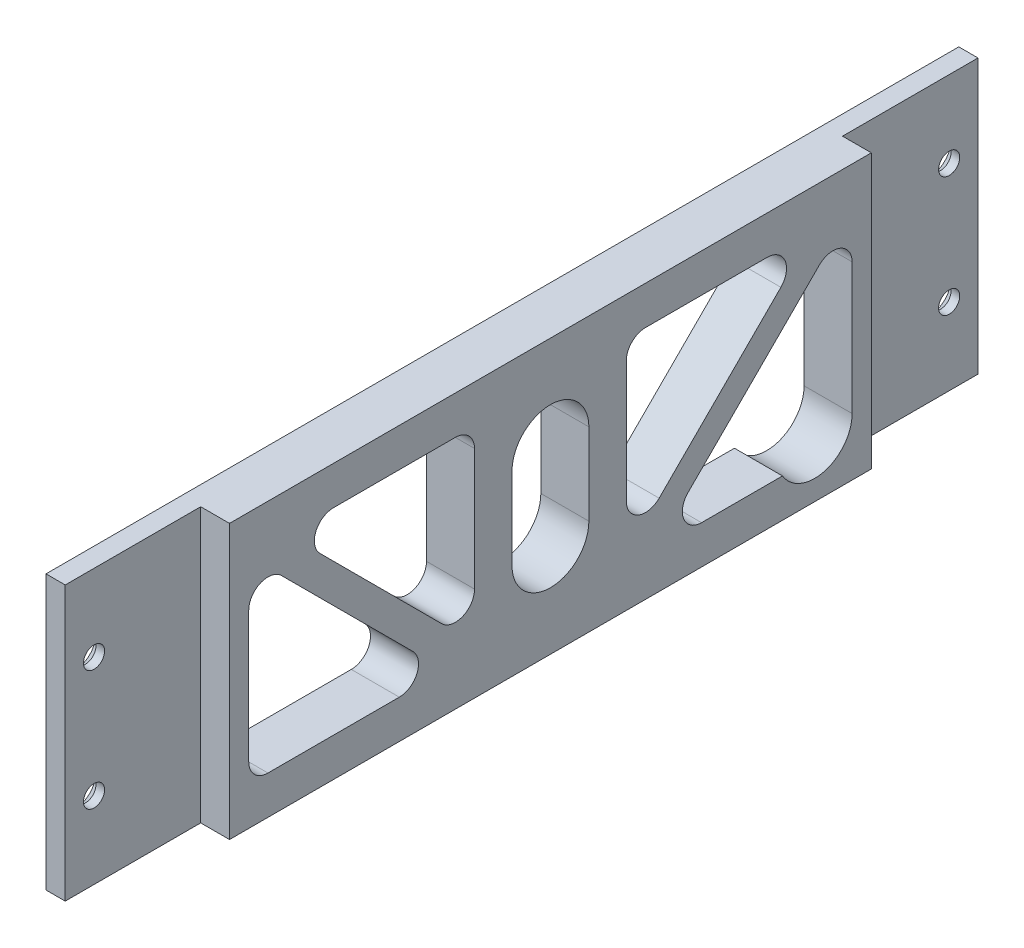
ISO-10303-21;
HEADER;
FILE_DESCRIPTION(('STEP AP214'),'2;1');
FILE_NAME('part.step','',(''),(''),'','','');
FILE_SCHEMA(('AUTOMOTIVE_DESIGN { 1 0 10303 214 1 1 1 1 }'));
ENDSEC;
DATA;
#1=APPLICATION_CONTEXT('core data for automotive mechanical design processes');
#2=APPLICATION_PROTOCOL_DEFINITION('international standard','automotive_design',2000,#1);
#3=PRODUCT_CONTEXT('',#1,'mechanical');
#4=PRODUCT('Part','Part','',(#3));
#5=PRODUCT_RELATED_PRODUCT_CATEGORY('part','',(#4));
#6=PRODUCT_DEFINITION_FORMATION('','',#4);
#7=PRODUCT_DEFINITION_CONTEXT('part definition',#1,'design');
#8=PRODUCT_DEFINITION('design','',#6,#7);
#9=PRODUCT_DEFINITION_SHAPE('','',#8);
#10=(LENGTH_UNIT() NAMED_UNIT(*) SI_UNIT(.MILLI.,.METRE.));
#11=(NAMED_UNIT(*) PLANE_ANGLE_UNIT() SI_UNIT($,.RADIAN.));
#12=(NAMED_UNIT(*) SI_UNIT($,.STERADIAN.) SOLID_ANGLE_UNIT());
#13=UNCERTAINTY_MEASURE_WITH_UNIT(LENGTH_MEASURE(1.E-05),#10,'distance_accuracy_value','');
#14=(GEOMETRIC_REPRESENTATION_CONTEXT(3) GLOBAL_UNCERTAINTY_ASSIGNED_CONTEXT((#13)) GLOBAL_UNIT_ASSIGNED_CONTEXT((#10,
#11,#12)) REPRESENTATION_CONTEXT('',''));
#15=CARTESIAN_POINT('',(0.,0.,0.));
#16=DIRECTION('',(0.,0.,1.));
#17=DIRECTION('',(1.,0.,0.));
#18=AXIS2_PLACEMENT_3D('',#15,#16,#17);
#19=CARTESIAN_POINT('',(0.,0.,0.));
#20=DIRECTION('',(-1.,0.,0.));
#21=DIRECTION('',(0.,0.,1.));
#22=AXIS2_PLACEMENT_3D('',#19,#20,#21);
#23=PLANE('',#22);
#24=CARTESIAN_POINT('',(0.,-8.25000000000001,-27.5));
#25=DIRECTION('',(-1.,0.,0.));
#26=DIRECTION('',(0.,0.,1.));
#27=AXIS2_PLACEMENT_3D('',#24,#25,#26);
#28=CIRCLE('',#27,3.9);
#29=CARTESIAN_POINT('',(0.,-8.25000000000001,-31.4));
#30=VERTEX_POINT('',#29);
#31=CARTESIAN_POINT('',(0.,-10.25,-24.1518661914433));
#32=VERTEX_POINT('',#31);
#33=EDGE_CURVE('E48',#30,#32,#28,.T.);
#34=ORIENTED_EDGE('',*,*,#33,.F.);
#35=DIRECTION('',(0.,-1.,0.));
#36=VECTOR('',#35,1.);
#37=CARTESIAN_POINT('',(0.,5.42157287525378,-31.4));
#38=LINE('',#37,#36);
#39=CARTESIAN_POINT('',(0.,5.42157287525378,-31.4));
#40=VERTEX_POINT('',#39);
#41=EDGE_CURVE('E280',#40,#30,#38,.T.);
#42=ORIENTED_EDGE('',*,*,#41,.F.);
#43=CARTESIAN_POINT('',(0.,5.42157287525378,-29.4));
#44=DIRECTION('',(-1.,0.,0.));
#45=DIRECTION('',(0.,0.,-1.));
#46=AXIS2_PLACEMENT_3D('',#43,#44,#45);
#47=CIRCLE('',#46,2.);
#48=CARTESIAN_POINT('',(0.,6.83578643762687,-27.9857864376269));
#49=VERTEX_POINT('',#48);
#50=EDGE_CURVE('E287',#49,#40,#47,.T.);
#51=ORIENTED_EDGE('',*,*,#50,.F.);
#52=DIRECTION('',(0.,0.707106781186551,-0.707106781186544));
#53=VECTOR('',#52,1.);
#54=CARTESIAN_POINT('',(0.,-6.83578643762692,-14.3142135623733));
#55=LINE('',#54,#53);
#56=CARTESIAN_POINT('',(0.,-6.83578643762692,-14.3142135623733));
#57=VERTEX_POINT('',#56);
#58=EDGE_CURVE('E292',#57,#49,#55,.T.);
#59=ORIENTED_EDGE('',*,*,#58,.F.);
#60=CARTESIAN_POINT('',(0.,-8.25000000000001,-15.7284271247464));
#61=DIRECTION('',(-1.,0.,0.));
#62=DIRECTION('',(0.,0.,1.));
#63=AXIS2_PLACEMENT_3D('',#60,#61,#62);
#64=CIRCLE('',#63,2.);
#65=CARTESIAN_POINT('',(0.,-10.25,-15.7284271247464));
#66=VERTEX_POINT('',#65);
#67=EDGE_CURVE('E559',#66,#57,#64,.T.);
#68=ORIENTED_EDGE('',*,*,#67,.F.);
#69=DIRECTION('',(0.,0.,1.));
#70=VECTOR('',#69,1.);
#71=CARTESIAN_POINT('',(0.,-10.25,-29.4));
#72=LINE('',#71,#70);
#73=EDGE_CURVE('E282',#32,#66,#72,.T.);
#74=ORIENTED_EDGE('',*,*,#73,.F.);
#75=EDGE_LOOP('',(#34,#42,#51,#59,#68,#74));
#76=FACE_BOUND('',#75,.T.);
#77=CARTESIAN_POINT('',(0.,4.25,0.));
#78=DIRECTION('',(-1.,0.,0.));
#79=DIRECTION('',(0.,0.,1.));
#80=AXIS2_PLACEMENT_3D('',#77,#78,#79);
#81=CIRCLE('',#80,4.);
#82=CARTESIAN_POINT('',(0.,4.25,4.));
#83=VERTEX_POINT('',#82);
#84=CARTESIAN_POINT('',(0.,4.25,-4.));
#85=VERTEX_POINT('',#84);
#86=EDGE_CURVE('E55',#83,#85,#81,.T.);
#87=ORIENTED_EDGE('',*,*,#86,.F.);
#88=DIRECTION('',(0.,1.,0.));
#89=VECTOR('',#88,1.);
#90=CARTESIAN_POINT('',(0.,4.25,4.));
#91=LINE('',#90,#89);
#92=CARTESIAN_POINT('',(0.,-4.25000000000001,4.));
#93=VERTEX_POINT('',#92);
#94=EDGE_CURVE('E478',#93,#83,#91,.T.);
#95=ORIENTED_EDGE('',*,*,#94,.F.);
#96=CARTESIAN_POINT('',(0.,-4.25000000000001,0.));
#97=DIRECTION('',(-1.,0.,0.));
#98=DIRECTION('',(0.,0.,1.));
#99=AXIS2_PLACEMENT_3D('',#96,#97,#98);
#100=CIRCLE('',#99,4.);
#101=CARTESIAN_POINT('',(0.,-4.25000000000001,-4.));
#102=VERTEX_POINT('',#101);
#103=EDGE_CURVE('E491',#102,#93,#100,.T.);
#104=ORIENTED_EDGE('',*,*,#103,.F.);
#105=DIRECTION('',(0.,-1.,0.));
#106=VECTOR('',#105,1.);
#107=CARTESIAN_POINT('',(0.,4.25,-4.));
#108=LINE('',#107,#106);
#109=EDGE_CURVE('E578',#85,#102,#108,.T.);
#110=ORIENTED_EDGE('',*,*,#109,.F.);
#111=EDGE_LOOP('',(#87,#95,#104,#110));
#112=FACE_BOUND('',#111,.T.);
#113=DIRECTION('',(0.,0.,1.));
#114=VECTOR('',#113,1.);
#115=CARTESIAN_POINT('',(0.,10.25,22.5715728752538));
#116=LINE('',#115,#114);
#117=CARTESIAN_POINT('',(0.,10.25,9.90000000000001));
#118=VERTEX_POINT('',#117);
#119=CARTESIAN_POINT('',(0.,10.25,22.5715728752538));
#120=VERTEX_POINT('',#119);
#121=EDGE_CURVE('E530',#118,#120,#116,.T.);
#122=ORIENTED_EDGE('',*,*,#121,.T.);
#123=CARTESIAN_POINT('',(0.,8.25,22.5715728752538));
#124=DIRECTION('',(1.,0.,0.));
#125=DIRECTION('',(0.,0.,-1.));
#126=AXIS2_PLACEMENT_3D('',#123,#124,#125);
#127=CIRCLE('',#126,2.);
#128=CARTESIAN_POINT('',(0.,6.8357864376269,23.9857864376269));
#129=VERTEX_POINT('',#128);
#130=EDGE_CURVE('E527',#120,#129,#127,.T.);
#131=ORIENTED_EDGE('',*,*,#130,.T.);
#132=DIRECTION('',(0.,-0.707106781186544,-0.707106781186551));
#133=VECTOR('',#132,1.);
#134=CARTESIAN_POINT('',(0.,-5.83578643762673,11.3142135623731));
#135=LINE('',#134,#133);
#136=CARTESIAN_POINT('',(0.,-5.83578643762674,11.3142135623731));
#137=VERTEX_POINT('',#136);
#138=EDGE_CURVE('E542',#129,#137,#135,.T.);
#139=ORIENTED_EDGE('',*,*,#138,.T.);
#140=CARTESIAN_POINT('',(0.,-4.42157287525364,9.9));
#141=DIRECTION('',(1.,0.,0.));
#142=DIRECTION('',(0.,0.,1.));
#143=AXIS2_PLACEMENT_3D('',#140,#141,#142);
#144=CIRCLE('',#143,2.);
#145=CARTESIAN_POINT('',(0.,-4.42157287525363,7.9));
#146=VERTEX_POINT('',#145);
#147=EDGE_CURVE('E539',#137,#146,#144,.T.);
#148=ORIENTED_EDGE('',*,*,#147,.T.);
#149=DIRECTION('',(0.,1.,0.));
#150=VECTOR('',#149,1.);
#151=CARTESIAN_POINT('',(0.,8.24999999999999,7.9));
#152=LINE('',#151,#150);
#153=CARTESIAN_POINT('',(0.,8.24999999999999,7.9));
#154=VERTEX_POINT('',#153);
#155=EDGE_CURVE('E536',#146,#154,#152,.T.);
#156=ORIENTED_EDGE('',*,*,#155,.T.);
#157=CARTESIAN_POINT('',(0.,8.25,9.9));
#158=DIRECTION('',(1.,0.,0.));
#159=DIRECTION('',(0.,0.,1.));
#160=AXIS2_PLACEMENT_3D('',#157,#158,#159);
#161=CIRCLE('',#160,2.);
#162=EDGE_CURVE('E533',#154,#118,#161,.T.);
#163=ORIENTED_EDGE('',*,*,#162,.T.);
#164=EDGE_LOOP('',(#122,#131,#139,#148,#156,#163));
#165=FACE_BOUND('',#164,.T.);
#166=CARTESIAN_POINT('',(0.,8.25,-22.5715728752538));
#167=DIRECTION('',(-1.,0.,0.));
#168=DIRECTION('',(0.,0.,1.));
#169=AXIS2_PLACEMENT_3D('',#166,#167,#168);
#170=CIRCLE('',#169,2.);
#171=CARTESIAN_POINT('',(0.,10.25,-22.5715728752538));
#172=VERTEX_POINT('',#171);
#173=CARTESIAN_POINT('',(0.,6.8357864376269,-23.9857864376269));
#174=VERTEX_POINT('',#173);
#175=EDGE_CURVE('E272',#172,#174,#170,.T.);
#176=ORIENTED_EDGE('',*,*,#175,.F.);
#177=DIRECTION('',(0.,0.,-1.));
#178=VECTOR('',#177,1.);
#179=CARTESIAN_POINT('',(0.,10.25,-22.5715728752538));
#180=LINE('',#179,#178);
#181=CARTESIAN_POINT('',(0.,10.25,-9.90000000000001));
#182=VERTEX_POINT('',#181);
#183=EDGE_CURVE('E313',#182,#172,#180,.T.);
#184=ORIENTED_EDGE('',*,*,#183,.F.);
#185=CARTESIAN_POINT('',(0.,8.25,-9.9));
#186=DIRECTION('',(-1.,0.,0.));
#187=DIRECTION('',(0.,0.,-1.));
#188=AXIS2_PLACEMENT_3D('',#185,#186,#187);
#189=CIRCLE('',#188,2.);
#190=CARTESIAN_POINT('',(0.,8.24999999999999,-7.9));
#191=VERTEX_POINT('',#190);
#192=EDGE_CURVE('E310',#191,#182,#189,.T.);
#193=ORIENTED_EDGE('',*,*,#192,.F.);
#194=DIRECTION('',(0.,1.,0.));
#195=VECTOR('',#194,1.);
#196=CARTESIAN_POINT('',(0.,8.24999999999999,-7.9));
#197=LINE('',#196,#195);
#198=CARTESIAN_POINT('',(0.,-4.42157287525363,-7.9));
#199=VERTEX_POINT('',#198);
#200=EDGE_CURVE('E307',#199,#191,#197,.T.);
#201=ORIENTED_EDGE('',*,*,#200,.F.);
#202=CARTESIAN_POINT('',(0.,-4.42157287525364,-9.9));
#203=DIRECTION('',(-1.,0.,0.));
#204=DIRECTION('',(0.,0.,-1.));
#205=AXIS2_PLACEMENT_3D('',#202,#203,#204);
#206=CIRCLE('',#205,2.);
#207=CARTESIAN_POINT('',(0.,-5.83578643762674,-11.3142135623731));
#208=VERTEX_POINT('',#207);
#209=EDGE_CURVE('E304',#208,#199,#206,.T.);
#210=ORIENTED_EDGE('',*,*,#209,.F.);
#211=DIRECTION('',(0.,-0.707106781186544,0.707106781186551));
#212=VECTOR('',#211,1.);
#213=CARTESIAN_POINT('',(0.,-5.83578643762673,-11.3142135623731));
#214=LINE('',#213,#212);
#215=EDGE_CURVE('E301',#174,#208,#214,.T.);
#216=ORIENTED_EDGE('',*,*,#215,.F.);
#217=EDGE_LOOP('',(#176,#184,#193,#201,#210,#216));
#218=FACE_BOUND('',#217,.T.);
#219=CARTESIAN_POINT('',(0.,6.25,44.5));
#220=DIRECTION('',(-1.,0.,0.));
#221=DIRECTION('',(0.,0.,1.));
#222=AXIS2_PLACEMENT_3D('',#219,#220,#221);
#223=CIRCLE('',#222,2.2);
#224=CARTESIAN_POINT('',(0.,6.25,46.7));
#225=VERTEX_POINT('',#224);
#226=EDGE_CURVE('E329',#225,#225,#223,.T.);
#227=ORIENTED_EDGE('',*,*,#226,.F.);
#228=EDGE_LOOP('',(#227));
#229=FACE_BOUND('',#228,.T.);
#230=CARTESIAN_POINT('',(0.,-6.25000000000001,44.5));
#231=DIRECTION('',(-1.,0.,0.));
#232=DIRECTION('',(0.,0.,1.));
#233=AXIS2_PLACEMENT_3D('',#230,#231,#232);
#234=CIRCLE('',#233,2.2);
#235=CARTESIAN_POINT('',(0.,-6.25000000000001,46.7));
#236=VERTEX_POINT('',#235);
#237=EDGE_CURVE('E336',#236,#236,#234,.T.);
#238=ORIENTED_EDGE('',*,*,#237,.F.);
#239=EDGE_LOOP('',(#238));
#240=FACE_BOUND('',#239,.T.);
#241=CARTESIAN_POINT('',(0.,6.25,-44.5));
#242=DIRECTION('',(-1.,0.,0.));
#243=DIRECTION('',(0.,0.,1.));
#244=AXIS2_PLACEMENT_3D('',#241,#242,#243);
#245=CIRCLE('',#244,2.2);
#246=CARTESIAN_POINT('',(0.,6.25,-42.3));
#247=VERTEX_POINT('',#246);
#248=EDGE_CURVE('E343',#247,#247,#245,.T.);
#249=ORIENTED_EDGE('',*,*,#248,.F.);
#250=EDGE_LOOP('',(#249));
#251=FACE_BOUND('',#250,.T.);
#252=CARTESIAN_POINT('',(0.,-6.25000000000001,-44.5));
#253=DIRECTION('',(-1.,0.,0.));
#254=DIRECTION('',(0.,0.,1.));
#255=AXIS2_PLACEMENT_3D('',#252,#253,#254);
#256=CIRCLE('',#255,2.2);
#257=CARTESIAN_POINT('',(0.,-6.25000000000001,-42.3));
#258=VERTEX_POINT('',#257);
#259=EDGE_CURVE('E350',#258,#258,#256,.T.);
#260=ORIENTED_EDGE('',*,*,#259,.F.);
#261=EDGE_LOOP('',(#260));
#262=FACE_BOUND('',#261,.T.);
#263=DIRECTION('',(0.,-1.,0.));
#264=VECTOR('',#263,1.);
#265=CARTESIAN_POINT('',(0.,14.25,47.5));
#266=LINE('',#265,#264);
#267=CARTESIAN_POINT('',(0.,14.25,47.5));
#268=VERTEX_POINT('',#267);
#269=CARTESIAN_POINT('',(0.,-14.25,47.5));
#270=VERTEX_POINT('',#269);
#271=EDGE_CURVE('E606',#268,#270,#266,.T.);
#272=ORIENTED_EDGE('',*,*,#271,.F.);
#273=DIRECTION('',(0.,0.,1.));
#274=VECTOR('',#273,1.);
#275=CARTESIAN_POINT('',(0.,14.25,-47.5));
#276=LINE('',#275,#274);
#277=CARTESIAN_POINT('',(0.,14.25,-47.5));
#278=VERTEX_POINT('',#277);
#279=EDGE_CURVE('E682',#278,#268,#276,.T.);
#280=ORIENTED_EDGE('',*,*,#279,.F.);
#281=DIRECTION('',(0.,1.,0.));
#282=VECTOR('',#281,1.);
#283=CARTESIAN_POINT('',(0.,14.25,-47.5));
#284=LINE('',#283,#282);
#285=CARTESIAN_POINT('',(0.,-14.25,-47.5));
#286=VERTEX_POINT('',#285);
#287=EDGE_CURVE('E675',#286,#278,#284,.T.);
#288=ORIENTED_EDGE('',*,*,#287,.F.);
#289=DIRECTION('',(0.,0.,-1.));
#290=VECTOR('',#289,1.);
#291=CARTESIAN_POINT('',(0.,-14.25,-47.5));
#292=LINE('',#291,#290);
#293=EDGE_CURVE('E668',#270,#286,#292,.T.);
#294=ORIENTED_EDGE('',*,*,#293,.F.);
#295=EDGE_LOOP('',(#272,#280,#288,#294));
#296=FACE_BOUND('',#295,.T.);
#297=DIRECTION('',(0.,-1.,0.));
#298=VECTOR('',#297,1.);
#299=CARTESIAN_POINT('',(0.,5.42157287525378,31.4));
#300=LINE('',#299,#298);
#301=CARTESIAN_POINT('',(0.,5.42157287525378,31.4));
#302=VERTEX_POINT('',#301);
#303=CARTESIAN_POINT('',(0.,-8.24999999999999,31.4));
#304=VERTEX_POINT('',#303);
#305=EDGE_CURVE('E499',#302,#304,#300,.T.);
#306=ORIENTED_EDGE('',*,*,#305,.T.);
#307=CARTESIAN_POINT('',(0.,-8.25000000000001,29.4));
#308=DIRECTION('',(1.,0.,0.));
#309=DIRECTION('',(0.,0.,-1.));
#310=AXIS2_PLACEMENT_3D('',#307,#308,#309);
#311=CIRCLE('',#310,2.);
#312=CARTESIAN_POINT('',(0.,-10.25,29.4));
#313=VERTEX_POINT('',#312);
#314=EDGE_CURVE('E479',#304,#313,#311,.T.);
#315=ORIENTED_EDGE('',*,*,#314,.T.);
#316=DIRECTION('',(0.,0.,-1.));
#317=VECTOR('',#316,1.);
#318=CARTESIAN_POINT('',(0.,-10.25,29.4));
#319=LINE('',#318,#317);
#320=CARTESIAN_POINT('',(0.,-10.25,15.7284271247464));
#321=VERTEX_POINT('',#320);
#322=EDGE_CURVE('E511',#313,#321,#319,.T.);
#323=ORIENTED_EDGE('',*,*,#322,.T.);
#324=CARTESIAN_POINT('',(0.,-8.25000000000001,15.7284271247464));
#325=DIRECTION('',(1.,0.,0.));
#326=DIRECTION('',(0.,0.,-1.));
#327=AXIS2_PLACEMENT_3D('',#324,#325,#326);
#328=CIRCLE('',#327,2.);
#329=CARTESIAN_POINT('',(0.,-6.83578643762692,14.3142135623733));
#330=VERTEX_POINT('',#329);
#331=EDGE_CURVE('E508',#321,#330,#328,.T.);
#332=ORIENTED_EDGE('',*,*,#331,.T.);
#333=DIRECTION('',(0.,0.707106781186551,0.707106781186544));
#334=VECTOR('',#333,1.);
#335=CARTESIAN_POINT('',(0.,-6.83578643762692,14.3142135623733));
#336=LINE('',#335,#334);
#337=CARTESIAN_POINT('',(0.,6.83578643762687,27.9857864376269));
#338=VERTEX_POINT('',#337);
#339=EDGE_CURVE('E505',#330,#338,#336,.T.);
#340=ORIENTED_EDGE('',*,*,#339,.T.);
#341=CARTESIAN_POINT('',(0.,5.42157287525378,29.4));
#342=DIRECTION('',(1.,0.,0.));
#343=DIRECTION('',(0.,0.,1.));
#344=AXIS2_PLACEMENT_3D('',#341,#342,#343);
#345=CIRCLE('',#344,2.);
#346=EDGE_CURVE('E502',#338,#302,#345,.T.);
#347=ORIENTED_EDGE('',*,*,#346,.T.);
#348=EDGE_LOOP('',(#306,#315,#323,#332,#340,#347));
#349=FACE_BOUND('',#348,.T.);
#350=ADVANCED_FACE('F33',(#76,#112,#165,#218,#229,#240,#251,#262,#296,#349),#23,.T.);
#351=CARTESIAN_POINT('',(5.,0.,0.));
#352=DIRECTION('',(1.,0.,0.));
#353=DIRECTION('',(0.,0.,-1.));
#354=AXIS2_PLACEMENT_3D('',#351,#352,#353);
#355=PLANE('',#354);
#356=CARTESIAN_POINT('',(5.,-8.25000000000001,-27.5));
#357=DIRECTION('',(1.,0.,0.));
#358=DIRECTION('',(0.,0.,-1.));
#359=AXIS2_PLACEMENT_3D('',#356,#357,#358);
#360=CIRCLE('',#359,3.9);
#361=CARTESIAN_POINT('',(5.,-10.25,-24.1518661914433));
#362=VERTEX_POINT('',#361);
#363=CARTESIAN_POINT('',(5.,-8.25000000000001,-31.4));
#364=VERTEX_POINT('',#363);
#365=EDGE_CURVE('E267',#362,#364,#360,.T.);
#366=ORIENTED_EDGE('',*,*,#365,.F.);
#367=DIRECTION('',(0.,0.,-1.));
#368=VECTOR('',#367,1.);
#369=CARTESIAN_POINT('',(5.,-10.25,-29.4));
#370=LINE('',#369,#368);
#371=CARTESIAN_POINT('',(5.,-10.25,-15.7284271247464));
#372=VERTEX_POINT('',#371);
#373=EDGE_CURVE('E410',#372,#362,#370,.T.);
#374=ORIENTED_EDGE('',*,*,#373,.F.);
#375=CARTESIAN_POINT('',(5.,-8.25000000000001,-15.7284271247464));
#376=DIRECTION('',(-1.,0.,0.));
#377=DIRECTION('',(0.,0.,1.));
#378=AXIS2_PLACEMENT_3D('',#375,#376,#377);
#379=CIRCLE('',#378,2.);
#380=CARTESIAN_POINT('',(5.,-6.83578643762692,-14.3142135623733));
#381=VERTEX_POINT('',#380);
#382=EDGE_CURVE('E413',#381,#372,#379,.F.);
#383=ORIENTED_EDGE('',*,*,#382,.F.);
#384=DIRECTION('',(0.,-0.707106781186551,0.707106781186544));
#385=VECTOR('',#384,1.);
#386=CARTESIAN_POINT('',(5.,-6.83578643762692,-14.3142135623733));
#387=LINE('',#386,#385);
#388=CARTESIAN_POINT('',(5.,6.83578643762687,-27.9857864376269));
#389=VERTEX_POINT('',#388);
#390=EDGE_CURVE('E415',#389,#381,#387,.T.);
#391=ORIENTED_EDGE('',*,*,#390,.F.);
#392=CARTESIAN_POINT('',(5.,5.42157287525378,-29.4));
#393=DIRECTION('',(-1.,0.,0.));
#394=DIRECTION('',(0.,0.,1.));
#395=AXIS2_PLACEMENT_3D('',#392,#393,#394);
#396=CIRCLE('',#395,2.);
#397=CARTESIAN_POINT('',(5.,5.42157287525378,-31.4));
#398=VERTEX_POINT('',#397);
#399=EDGE_CURVE('E418',#398,#389,#396,.F.);
#400=ORIENTED_EDGE('',*,*,#399,.F.);
#401=DIRECTION('',(0.,1.,0.));
#402=VECTOR('',#401,1.);
#403=CARTESIAN_POINT('',(5.,5.42157287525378,-31.4));
#404=LINE('',#403,#402);
#405=EDGE_CURVE('E421',#364,#398,#404,.T.);
#406=ORIENTED_EDGE('',*,*,#405,.F.);
#407=EDGE_LOOP('',(#366,#374,#383,#391,#400,#406));
#408=FACE_BOUND('',#407,.T.);
#409=CARTESIAN_POINT('',(5.,4.25,0.));
#410=DIRECTION('',(1.,0.,0.));
#411=DIRECTION('',(0.,0.,-1.));
#412=AXIS2_PLACEMENT_3D('',#409,#410,#411);
#413=CIRCLE('',#412,4.);
#414=CARTESIAN_POINT('',(5.,4.25,-4.));
#415=VERTEX_POINT('',#414);
#416=CARTESIAN_POINT('',(5.,4.25,4.));
#417=VERTEX_POINT('',#416);
#418=EDGE_CURVE('E41',#415,#417,#413,.T.);
#419=ORIENTED_EDGE('',*,*,#418,.F.);
#420=DIRECTION('',(0.,1.,0.));
#421=VECTOR('',#420,1.);
#422=CARTESIAN_POINT('',(5.,0.,-4.));
#423=LINE('',#422,#421);
#424=CARTESIAN_POINT('',(5.,-4.25000000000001,-4.));
#425=VERTEX_POINT('',#424);
#426=EDGE_CURVE('E459',#425,#415,#423,.T.);
#427=ORIENTED_EDGE('',*,*,#426,.F.);
#428=CARTESIAN_POINT('',(5.,-4.25000000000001,0.));
#429=DIRECTION('',(1.,0.,0.));
#430=DIRECTION('',(0.,0.,-1.));
#431=AXIS2_PLACEMENT_3D('',#428,#429,#430);
#432=CIRCLE('',#431,4.);
#433=CARTESIAN_POINT('',(5.,-4.25000000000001,4.));
#434=VERTEX_POINT('',#433);
#435=EDGE_CURVE('E461',#434,#425,#432,.T.);
#436=ORIENTED_EDGE('',*,*,#435,.F.);
#437=DIRECTION('',(0.,-1.,0.));
#438=VECTOR('',#437,1.);
#439=CARTESIAN_POINT('',(5.,0.,4.));
#440=LINE('',#439,#438);
#441=EDGE_CURVE('E464',#417,#434,#440,.T.);
#442=ORIENTED_EDGE('',*,*,#441,.F.);
#443=EDGE_LOOP('',(#419,#427,#436,#442));
#444=FACE_BOUND('',#443,.T.);
#445=DIRECTION('',(0.,0.707106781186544,0.707106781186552));
#446=VECTOR('',#445,1.);
#447=CARTESIAN_POINT('',(5.,-5.83578643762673,11.3142135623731));
#448=LINE('',#447,#446);
#449=CARTESIAN_POINT('',(5.,-5.83578643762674,11.3142135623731));
#450=VERTEX_POINT('',#449);
#451=CARTESIAN_POINT('',(5.,6.8357864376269,23.9857864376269));
#452=VERTEX_POINT('',#451);
#453=EDGE_CURVE('E435',#450,#452,#448,.T.);
#454=ORIENTED_EDGE('',*,*,#453,.T.);
#455=CARTESIAN_POINT('',(5.,8.25,22.5715728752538));
#456=DIRECTION('',(-1.,0.,0.));
#457=DIRECTION('',(0.,0.,1.));
#458=AXIS2_PLACEMENT_3D('',#455,#456,#457);
#459=CIRCLE('',#458,2.);
#460=CARTESIAN_POINT('',(5.,10.25,22.5715728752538));
#461=VERTEX_POINT('',#460);
#462=EDGE_CURVE('E438',#452,#461,#459,.T.);
#463=ORIENTED_EDGE('',*,*,#462,.T.);
#464=DIRECTION('',(0.,0.,-1.));
#465=VECTOR('',#464,1.);
#466=CARTESIAN_POINT('',(5.,10.25,0.));
#467=LINE('',#466,#465);
#468=CARTESIAN_POINT('',(5.,10.25,9.9));
#469=VERTEX_POINT('',#468);
#470=EDGE_CURVE('E423',#461,#469,#467,.T.);
#471=ORIENTED_EDGE('',*,*,#470,.T.);
#472=CARTESIAN_POINT('',(5.,8.25,9.9));
#473=DIRECTION('',(-1.,0.,0.));
#474=DIRECTION('',(0.,0.,1.));
#475=AXIS2_PLACEMENT_3D('',#472,#473,#474);
#476=CIRCLE('',#475,2.);
#477=CARTESIAN_POINT('',(5.,8.24999999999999,7.9));
#478=VERTEX_POINT('',#477);
#479=EDGE_CURVE('E426',#469,#478,#476,.T.);
#480=ORIENTED_EDGE('',*,*,#479,.T.);
#481=DIRECTION('',(0.,1.,0.));
#482=VECTOR('',#481,1.);
#483=CARTESIAN_POINT('',(5.,0.,7.9));
#484=LINE('',#483,#482);
#485=CARTESIAN_POINT('',(5.,-4.42157287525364,7.9));
#486=VERTEX_POINT('',#485);
#487=EDGE_CURVE('E429',#478,#486,#484,.F.);
#488=ORIENTED_EDGE('',*,*,#487,.T.);
#489=CARTESIAN_POINT('',(5.,-4.42157287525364,9.9));
#490=DIRECTION('',(-1.,0.,0.));
#491=DIRECTION('',(0.,0.,1.));
#492=AXIS2_PLACEMENT_3D('',#489,#490,#491);
#493=CIRCLE('',#492,2.);
#494=EDGE_CURVE('E432',#486,#450,#493,.T.);
#495=ORIENTED_EDGE('',*,*,#494,.T.);
#496=EDGE_LOOP('',(#454,#463,#471,#480,#488,#495));
#497=FACE_BOUND('',#496,.T.);
#498=CARTESIAN_POINT('',(5.,8.25,-22.5715728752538));
#499=DIRECTION('',(-1.,0.,0.));
#500=DIRECTION('',(0.,0.,1.));
#501=AXIS2_PLACEMENT_3D('',#498,#499,#500);
#502=CIRCLE('',#501,2.);
#503=CARTESIAN_POINT('',(5.,6.8357864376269,-23.9857864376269));
#504=VERTEX_POINT('',#503);
#505=CARTESIAN_POINT('',(5.,10.25,-22.5715728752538));
#506=VERTEX_POINT('',#505);
#507=EDGE_CURVE('E407',#504,#506,#502,.F.);
#508=ORIENTED_EDGE('',*,*,#507,.F.);
#509=DIRECTION('',(0.,0.707106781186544,-0.707106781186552));
#510=VECTOR('',#509,1.);
#511=CARTESIAN_POINT('',(5.,-5.83578643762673,-11.3142135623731));
#512=LINE('',#511,#510);
#513=CARTESIAN_POINT('',(5.,-5.83578643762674,-11.3142135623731));
#514=VERTEX_POINT('',#513);
#515=EDGE_CURVE('E392',#514,#504,#512,.T.);
#516=ORIENTED_EDGE('',*,*,#515,.F.);
#517=CARTESIAN_POINT('',(5.,-4.42157287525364,-9.9));
#518=DIRECTION('',(-1.,0.,0.));
#519=DIRECTION('',(0.,0.,1.));
#520=AXIS2_PLACEMENT_3D('',#517,#518,#519);
#521=CIRCLE('',#520,2.);
#522=CARTESIAN_POINT('',(5.,-4.42157287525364,-7.9));
#523=VERTEX_POINT('',#522);
#524=EDGE_CURVE('E395',#523,#514,#521,.F.);
#525=ORIENTED_EDGE('',*,*,#524,.F.);
#526=DIRECTION('',(0.,-1.,0.));
#527=VECTOR('',#526,1.);
#528=CARTESIAN_POINT('',(5.,8.24999999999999,-7.9));
#529=LINE('',#528,#527);
#530=CARTESIAN_POINT('',(5.,8.24999999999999,-7.9));
#531=VERTEX_POINT('',#530);
#532=EDGE_CURVE('E398',#531,#523,#529,.T.);
#533=ORIENTED_EDGE('',*,*,#532,.F.);
#534=CARTESIAN_POINT('',(5.,8.25,-9.9));
#535=DIRECTION('',(-1.,0.,0.));
#536=DIRECTION('',(0.,0.,1.));
#537=AXIS2_PLACEMENT_3D('',#534,#535,#536);
#538=CIRCLE('',#537,2.);
#539=CARTESIAN_POINT('',(5.,10.25,-9.9));
#540=VERTEX_POINT('',#539);
#541=EDGE_CURVE('E401',#540,#531,#538,.F.);
#542=ORIENTED_EDGE('',*,*,#541,.F.);
#543=DIRECTION('',(0.,0.,1.));
#544=VECTOR('',#543,1.);
#545=CARTESIAN_POINT('',(5.,10.25,-22.5715728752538));
#546=LINE('',#545,#544);
#547=EDGE_CURVE('E404',#506,#540,#546,.T.);
#548=ORIENTED_EDGE('',*,*,#547,.F.);
#549=EDGE_LOOP('',(#508,#516,#525,#533,#542,#548));
#550=FACE_BOUND('',#549,.T.);
#551=DIRECTION('',(0.,-1.,0.));
#552=VECTOR('',#551,1.);
#553=CARTESIAN_POINT('',(5.,14.25,33.4));
#554=LINE('',#553,#552);
#555=CARTESIAN_POINT('',(5.,14.25,33.4));
#556=VERTEX_POINT('',#555);
#557=CARTESIAN_POINT('',(5.,-14.25,33.4));
#558=VERTEX_POINT('',#557);
#559=EDGE_CURVE('E357',#556,#558,#554,.T.);
#560=ORIENTED_EDGE('',*,*,#559,.T.);
#561=DIRECTION('',(0.,0.,-1.));
#562=VECTOR('',#561,1.);
#563=CARTESIAN_POINT('',(5.,-14.25,33.4));
#564=LINE('',#563,#562);
#565=CARTESIAN_POINT('',(5.,-14.25,-33.4));
#566=VERTEX_POINT('',#565);
#567=EDGE_CURVE('E360',#558,#566,#564,.T.);
#568=ORIENTED_EDGE('',*,*,#567,.T.);
#569=DIRECTION('',(0.,1.,0.));
#570=VECTOR('',#569,1.);
#571=CARTESIAN_POINT('',(5.,14.25,-33.4));
#572=LINE('',#571,#570);
#573=CARTESIAN_POINT('',(5.,14.25,-33.4));
#574=VERTEX_POINT('',#573);
#575=EDGE_CURVE('E363',#566,#574,#572,.T.);
#576=ORIENTED_EDGE('',*,*,#575,.T.);
#577=DIRECTION('',(0.,0.,1.));
#578=VECTOR('',#577,1.);
#579=CARTESIAN_POINT('',(5.,14.25,33.4));
#580=LINE('',#579,#578);
#581=EDGE_CURVE('E365',#574,#556,#580,.T.);
#582=ORIENTED_EDGE('',*,*,#581,.T.);
#583=EDGE_LOOP('',(#560,#568,#576,#582));
#584=FACE_BOUND('',#583,.T.);
#585=DIRECTION('',(0.,0.,-1.));
#586=VECTOR('',#585,1.);
#587=CARTESIAN_POINT('',(5.,-10.25,0.));
#588=LINE('',#587,#586);
#589=CARTESIAN_POINT('',(5.,-10.25,15.7284271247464));
#590=VERTEX_POINT('',#589);
#591=CARTESIAN_POINT('',(5.,-10.25,29.4));
#592=VERTEX_POINT('',#591);
#593=EDGE_CURVE('E453',#590,#592,#588,.F.);
#594=ORIENTED_EDGE('',*,*,#593,.T.);
#595=CARTESIAN_POINT('',(5.,-8.25000000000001,29.4));
#596=DIRECTION('',(-1.,0.,0.));
#597=DIRECTION('',(0.,0.,1.));
#598=AXIS2_PLACEMENT_3D('',#595,#596,#597);
#599=CIRCLE('',#598,2.);
#600=CARTESIAN_POINT('',(5.,-8.25,31.4));
#601=VERTEX_POINT('',#600);
#602=EDGE_CURVE('E456',#592,#601,#599,.T.);
#603=ORIENTED_EDGE('',*,*,#602,.T.);
#604=DIRECTION('',(0.,1.,0.));
#605=VECTOR('',#604,1.);
#606=CARTESIAN_POINT('',(5.,0.,31.4));
#607=LINE('',#606,#605);
#608=CARTESIAN_POINT('',(5.,5.42157287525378,31.4));
#609=VERTEX_POINT('',#608);
#610=EDGE_CURVE('E441',#601,#609,#607,.T.);
#611=ORIENTED_EDGE('',*,*,#610,.T.);
#612=CARTESIAN_POINT('',(5.,5.42157287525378,29.4));
#613=DIRECTION('',(-1.,0.,0.));
#614=DIRECTION('',(0.,0.,1.));
#615=AXIS2_PLACEMENT_3D('',#612,#613,#614);
#616=CIRCLE('',#615,2.);
#617=CARTESIAN_POINT('',(5.,6.83578643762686,27.9857864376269));
#618=VERTEX_POINT('',#617);
#619=EDGE_CURVE('E444',#609,#618,#616,.T.);
#620=ORIENTED_EDGE('',*,*,#619,.T.);
#621=DIRECTION('',(0.,-0.707106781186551,-0.707106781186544));
#622=VECTOR('',#621,1.);
#623=CARTESIAN_POINT('',(5.,6.83578643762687,27.9857864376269));
#624=LINE('',#623,#622);
#625=CARTESIAN_POINT('',(5.,-6.83578643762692,14.3142135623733));
#626=VERTEX_POINT('',#625);
#627=EDGE_CURVE('E447',#618,#626,#624,.T.);
#628=ORIENTED_EDGE('',*,*,#627,.T.);
#629=CARTESIAN_POINT('',(5.,-8.25000000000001,15.7284271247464));
#630=DIRECTION('',(-1.,0.,0.));
#631=DIRECTION('',(0.,0.,1.));
#632=AXIS2_PLACEMENT_3D('',#629,#630,#631);
#633=CIRCLE('',#632,2.);
#634=EDGE_CURVE('E450',#626,#590,#633,.T.);
#635=ORIENTED_EDGE('',*,*,#634,.T.);
#636=EDGE_LOOP('',(#594,#603,#611,#620,#628,#635));
#637=FACE_BOUND('',#636,.T.);
#638=ADVANCED_FACE('F483',(#408,#444,#497,#550,#584,#637),#355,.T.);
#639=CARTESIAN_POINT('',(2.,0.,0.));
#640=DIRECTION('',(-1.,0.,0.));
#641=DIRECTION('',(0.,0.,1.));
#642=AXIS2_PLACEMENT_3D('',#639,#640,#641);
#643=PLANE('',#642);
#644=CARTESIAN_POINT('',(2.,6.25,44.5));
#645=DIRECTION('',(-1.,0.,0.));
#646=DIRECTION('',(0.,0.,1.));
#647=AXIS2_PLACEMENT_3D('',#644,#645,#646);
#648=CIRCLE('',#647,1.09999999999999);
#649=CARTESIAN_POINT('',(2.,6.25,45.6));
#650=VERTEX_POINT('',#649);
#651=EDGE_CURVE('E335',#650,#650,#648,.T.);
#652=ORIENTED_EDGE('',*,*,#651,.T.);
#653=EDGE_LOOP('',(#652));
#654=FACE_BOUND('',#653,.T.);
#655=CARTESIAN_POINT('',(2.,-6.25000000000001,44.5));
#656=DIRECTION('',(-1.,0.,0.));
#657=DIRECTION('',(0.,0.,1.));
#658=AXIS2_PLACEMENT_3D('',#655,#656,#657);
#659=CIRCLE('',#658,1.09999999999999);
#660=CARTESIAN_POINT('',(2.,-6.25000000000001,45.6));
#661=VERTEX_POINT('',#660);
#662=EDGE_CURVE('E342',#661,#661,#659,.T.);
#663=ORIENTED_EDGE('',*,*,#662,.T.);
#664=EDGE_LOOP('',(#663));
#665=FACE_BOUND('',#664,.T.);
#666=DIRECTION('',(0.,-1.,0.));
#667=VECTOR('',#666,1.);
#668=CARTESIAN_POINT('',(2.,14.25,33.4));
#669=LINE('',#668,#667);
#670=CARTESIAN_POINT('',(2.,14.25,33.4));
#671=VERTEX_POINT('',#670);
#672=CARTESIAN_POINT('',(2.,-14.25,33.4));
#673=VERTEX_POINT('',#672);
#674=EDGE_CURVE('E373',#671,#673,#669,.T.);
#675=ORIENTED_EDGE('',*,*,#674,.F.);
#676=DIRECTION('',(0.,0.,1.));
#677=VECTOR('',#676,1.);
#678=CARTESIAN_POINT('',(2.,14.25,-47.5));
#679=LINE('',#678,#677);
#680=CARTESIAN_POINT('',(2.,14.25,47.5));
#681=VERTEX_POINT('',#680);
#682=EDGE_CURVE('E703',#671,#681,#679,.T.);
#683=ORIENTED_EDGE('',*,*,#682,.T.);
#684=DIRECTION('',(0.,-1.,0.));
#685=VECTOR('',#684,1.);
#686=CARTESIAN_POINT('',(2.,14.25,47.5));
#687=LINE('',#686,#685);
#688=CARTESIAN_POINT('',(2.,-14.25,47.5));
#689=VERTEX_POINT('',#688);
#690=EDGE_CURVE('E684',#681,#689,#687,.T.);
#691=ORIENTED_EDGE('',*,*,#690,.T.);
#692=DIRECTION('',(0.,0.,-1.));
#693=VECTOR('',#692,1.);
#694=CARTESIAN_POINT('',(2.,-14.25,-47.5));
#695=LINE('',#694,#693);
#696=EDGE_CURVE('E694',#689,#673,#695,.T.);
#697=ORIENTED_EDGE('',*,*,#696,.T.);
#698=EDGE_LOOP('',(#675,#683,#691,#697));
#699=FACE_BOUND('',#698,.T.);
#700=ADVANCED_FACE('F632',(#654,#665,#699),#643,.F.);
#701=CARTESIAN_POINT('',(2.,6.25,-44.5));
#702=DIRECTION('',(-1.,0.,0.));
#703=DIRECTION('',(0.,0.,1.));
#704=AXIS2_PLACEMENT_3D('',#701,#702,#703);
#705=CIRCLE('',#704,1.09999999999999);
#706=CARTESIAN_POINT('',(2.,6.25,-43.4));
#707=VERTEX_POINT('',#706);
#708=EDGE_CURVE('E349',#707,#707,#705,.T.);
#709=ORIENTED_EDGE('',*,*,#708,.T.);
#710=EDGE_LOOP('',(#709));
#711=FACE_BOUND('',#710,.T.);
#712=CARTESIAN_POINT('',(2.,-6.25000000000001,-44.5));
#713=DIRECTION('',(-1.,0.,0.));
#714=DIRECTION('',(0.,0.,1.));
#715=AXIS2_PLACEMENT_3D('',#712,#713,#714);
#716=CIRCLE('',#715,1.09999999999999);
#717=CARTESIAN_POINT('',(2.,-6.25000000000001,-43.4));
#718=VERTEX_POINT('',#717);
#719=EDGE_CURVE('E356',#718,#718,#716,.T.);
#720=ORIENTED_EDGE('',*,*,#719,.T.);
#721=EDGE_LOOP('',(#720));
#722=FACE_BOUND('',#721,.T.);
#723=DIRECTION('',(0.,1.,0.));
#724=VECTOR('',#723,1.);
#725=CARTESIAN_POINT('',(2.,14.25,-33.4));
#726=LINE('',#725,#724);
#727=CARTESIAN_POINT('',(2.,-14.25,-33.4));
#728=VERTEX_POINT('',#727);
#729=CARTESIAN_POINT('',(2.,14.25,-33.4));
#730=VERTEX_POINT('',#729);
#731=EDGE_CURVE('E361',#728,#730,#726,.T.);
#732=ORIENTED_EDGE('',*,*,#731,.F.);
#733=CARTESIAN_POINT('',(2.,-14.25,-47.5));
#734=VERTEX_POINT('',#733);
#735=EDGE_CURVE('E697',#728,#734,#695,.T.);
#736=ORIENTED_EDGE('',*,*,#735,.T.);
#737=DIRECTION('',(0.,1.,0.));
#738=VECTOR('',#737,1.);
#739=CARTESIAN_POINT('',(2.,14.25,-47.5));
#740=LINE('',#739,#738);
#741=CARTESIAN_POINT('',(2.,14.25,-47.5));
#742=VERTEX_POINT('',#741);
#743=EDGE_CURVE('E679',#734,#742,#740,.T.);
#744=ORIENTED_EDGE('',*,*,#743,.T.);
#745=EDGE_CURVE('E691',#742,#730,#679,.T.);
#746=ORIENTED_EDGE('',*,*,#745,.T.);
#747=EDGE_LOOP('',(#732,#736,#744,#746));
#748=FACE_BOUND('',#747,.T.);
#749=ADVANCED_FACE('F637',(#711,#722,#748),#643,.F.);
#750=CARTESIAN_POINT('',(2.,14.25,47.5));
#751=DIRECTION('',(0.,0.,-1.));
#752=DIRECTION('',(-1.,0.,0.));
#753=AXIS2_PLACEMENT_3D('',#750,#751,#752);
#754=PLANE('',#753);
#755=ORIENTED_EDGE('',*,*,#271,.T.);
#756=DIRECTION('',(-1.,0.,0.));
#757=VECTOR('',#756,1.);
#758=CARTESIAN_POINT('',(2.,-14.25,47.5));
#759=LINE('',#758,#757);
#760=EDGE_CURVE('E396',#689,#270,#759,.T.);
#761=ORIENTED_EDGE('',*,*,#760,.F.);
#762=ORIENTED_EDGE('',*,*,#690,.F.);
#763=DIRECTION('',(-1.,0.,0.));
#764=VECTOR('',#763,1.);
#765=CARTESIAN_POINT('',(2.,14.25,47.5));
#766=LINE('',#765,#764);
#767=EDGE_CURVE('E688',#681,#268,#766,.T.);
#768=ORIENTED_EDGE('',*,*,#767,.T.);
#769=EDGE_LOOP('',(#755,#761,#762,#768));
#770=FACE_BOUND('',#769,.T.);
#771=ADVANCED_FACE('F35',(#770),#754,.F.);
#772=CARTESIAN_POINT('',(2.,-14.25,-47.5));
#773=DIRECTION('',(0.,1.,0.));
#774=DIRECTION('',(0.,0.,1.));
#775=AXIS2_PLACEMENT_3D('',#772,#773,#774);
#776=PLANE('',#775);
#777=ORIENTED_EDGE('',*,*,#293,.T.);
#778=DIRECTION('',(-1.,0.,0.));
#779=VECTOR('',#778,1.);
#780=CARTESIAN_POINT('',(2.,-14.25,-47.5));
#781=LINE('',#780,#779);
#782=EDGE_CURVE('E671',#734,#286,#781,.T.);
#783=ORIENTED_EDGE('',*,*,#782,.F.);
#784=ORIENTED_EDGE('',*,*,#735,.F.);
#785=DIRECTION('',(-1.,0.,0.));
#786=VECTOR('',#785,1.);
#787=CARTESIAN_POINT('',(5.,-14.25,-33.4));
#788=LINE('',#787,#786);
#789=EDGE_CURVE('E719',#566,#728,#788,.T.);
#790=ORIENTED_EDGE('',*,*,#789,.F.);
#791=ORIENTED_EDGE('',*,*,#567,.F.);
#792=DIRECTION('',(-1.,0.,0.));
#793=VECTOR('',#792,1.);
#794=CARTESIAN_POINT('',(5.,-14.25,33.4));
#795=LINE('',#794,#793);
#796=EDGE_CURVE('E723',#558,#673,#795,.T.);
#797=ORIENTED_EDGE('',*,*,#796,.T.);
#798=ORIENTED_EDGE('',*,*,#696,.F.);
#799=ORIENTED_EDGE('',*,*,#760,.T.);
#800=EDGE_LOOP('',(#777,#783,#784,#790,#791,#797,#798,#799));
#801=FACE_BOUND('',#800,.T.);
#802=ADVANCED_FACE('F658',(#801),#776,.F.);
#803=CARTESIAN_POINT('',(2.,14.25,-47.5));
#804=DIRECTION('',(0.,0.,1.));
#805=DIRECTION('',(1.,0.,0.));
#806=AXIS2_PLACEMENT_3D('',#803,#804,#805);
#807=PLANE('',#806);
#808=ORIENTED_EDGE('',*,*,#287,.T.);
#809=DIRECTION('',(-1.,0.,0.));
#810=VECTOR('',#809,1.);
#811=CARTESIAN_POINT('',(2.,14.25,-47.5));
#812=LINE('',#811,#810);
#813=EDGE_CURVE('E680',#742,#278,#812,.T.);
#814=ORIENTED_EDGE('',*,*,#813,.F.);
#815=ORIENTED_EDGE('',*,*,#743,.F.);
#816=ORIENTED_EDGE('',*,*,#782,.T.);
#817=EDGE_LOOP('',(#808,#814,#815,#816));
#818=FACE_BOUND('',#817,.T.);
#819=ADVANCED_FACE('F655',(#818),#807,.F.);
#820=CARTESIAN_POINT('',(2.,14.25,-47.5));
#821=DIRECTION('',(0.,-1.,0.));
#822=DIRECTION('',(0.,0.,-1.));
#823=AXIS2_PLACEMENT_3D('',#820,#821,#822);
#824=PLANE('',#823);
#825=ORIENTED_EDGE('',*,*,#279,.T.);
#826=ORIENTED_EDGE('',*,*,#767,.F.);
#827=ORIENTED_EDGE('',*,*,#682,.F.);
#828=DIRECTION('',(-1.,0.,0.));
#829=VECTOR('',#828,1.);
#830=CARTESIAN_POINT('',(5.,14.25,33.4));
#831=LINE('',#830,#829);
#832=EDGE_CURVE('E367',#556,#671,#831,.T.);
#833=ORIENTED_EDGE('',*,*,#832,.F.);
#834=ORIENTED_EDGE('',*,*,#581,.F.);
#835=DIRECTION('',(-1.,0.,0.));
#836=VECTOR('',#835,1.);
#837=CARTESIAN_POINT('',(5.,14.25,-33.4));
#838=LINE('',#837,#836);
#839=EDGE_CURVE('E381',#574,#730,#838,.T.);
#840=ORIENTED_EDGE('',*,*,#839,.T.);
#841=ORIENTED_EDGE('',*,*,#745,.F.);
#842=ORIENTED_EDGE('',*,*,#813,.T.);
#843=EDGE_LOOP('',(#825,#826,#827,#833,#834,#840,#841,#842));
#844=FACE_BOUND('',#843,.T.);
#845=ADVANCED_FACE('F650',(#844),#824,.F.);
#846=CARTESIAN_POINT('',(5.,14.25,33.4));
#847=DIRECTION('',(0.,0.,-1.));
#848=DIRECTION('',(-1.,0.,0.));
#849=AXIS2_PLACEMENT_3D('',#846,#847,#848);
#850=PLANE('',#849);
#851=ORIENTED_EDGE('',*,*,#674,.T.);
#852=ORIENTED_EDGE('',*,*,#796,.F.);
#853=ORIENTED_EDGE('',*,*,#559,.F.);
#854=ORIENTED_EDGE('',*,*,#832,.T.);
#855=EDGE_LOOP('',(#851,#852,#853,#854));
#856=FACE_BOUND('',#855,.T.);
#857=ADVANCED_FACE('F647',(#856),#850,.F.);
#858=CARTESIAN_POINT('',(5.,14.25,-33.4));
#859=DIRECTION('',(0.,0.,1.));
#860=DIRECTION('',(1.,0.,0.));
#861=AXIS2_PLACEMENT_3D('',#858,#859,#860);
#862=PLANE('',#861);
#863=ORIENTED_EDGE('',*,*,#731,.T.);
#864=ORIENTED_EDGE('',*,*,#839,.F.);
#865=ORIENTED_EDGE('',*,*,#575,.F.);
#866=ORIENTED_EDGE('',*,*,#789,.T.);
#867=EDGE_LOOP('',(#863,#864,#865,#866));
#868=FACE_BOUND('',#867,.T.);
#869=ADVANCED_FACE('F644',(#868),#862,.F.);
#870=CARTESIAN_POINT('',(0.,-6.25000000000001,-44.5));
#871=DIRECTION('',(-1.,0.,0.));
#872=DIRECTION('',(0.,0.,1.));
#873=AXIS2_PLACEMENT_3D('',#870,#871,#872);
#874=CYLINDRICAL_SURFACE('',#873,1.09999999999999);
#875=CARTESIAN_POINT('',(1.09999999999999,-6.25000000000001,-44.5));
#876=DIRECTION('',(-1.,0.,0.));
#877=DIRECTION('',(0.,0.,1.));
#878=AXIS2_PLACEMENT_3D('',#875,#876,#877);
#879=CIRCLE('',#878,1.09999999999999);
#880=CARTESIAN_POINT('',(1.09999999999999,-6.25000000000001,-43.4));
#881=VERTEX_POINT('',#880);
#882=EDGE_CURVE('E353',#881,#881,#879,.T.);
#883=ORIENTED_EDGE('',*,*,#882,.T.);
#884=EDGE_LOOP('',(#883));
#885=FACE_BOUND('',#884,.T.);
#886=ORIENTED_EDGE('',*,*,#719,.F.);
#887=EDGE_LOOP('',(#886));
#888=FACE_BOUND('',#887,.T.);
#889=ADVANCED_FACE('F642',(#885,#888),#874,.F.);
#890=CARTESIAN_POINT('',(0.,-6.25000000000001,-44.5));
#891=DIRECTION('',(-1.,0.,0.));
#892=DIRECTION('',(0.,0.,1.));
#893=AXIS2_PLACEMENT_3D('',#890,#891,#892);
#894=CONICAL_SURFACE('',#893,2.2,0.785398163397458);
#895=ORIENTED_EDGE('',*,*,#882,.F.);
#896=EDGE_LOOP('',(#895));
#897=FACE_BOUND('',#896,.T.);
#898=ORIENTED_EDGE('',*,*,#259,.T.);
#899=EDGE_LOOP('',(#898));
#900=FACE_BOUND('',#899,.T.);
#901=ADVANCED_FACE('F744',(#897,#900),#894,.F.);
#902=CARTESIAN_POINT('',(0.,6.25,-44.5));
#903=DIRECTION('',(-1.,0.,0.));
#904=DIRECTION('',(0.,0.,1.));
#905=AXIS2_PLACEMENT_3D('',#902,#903,#904);
#906=CYLINDRICAL_SURFACE('',#905,1.09999999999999);
#907=CARTESIAN_POINT('',(1.09999999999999,6.25,-44.5));
#908=DIRECTION('',(-1.,0.,0.));
#909=DIRECTION('',(0.,0.,1.));
#910=AXIS2_PLACEMENT_3D('',#907,#908,#909);
#911=CIRCLE('',#910,1.09999999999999);
#912=CARTESIAN_POINT('',(1.09999999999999,6.25,-43.4));
#913=VERTEX_POINT('',#912);
#914=EDGE_CURVE('E346',#913,#913,#911,.T.);
#915=ORIENTED_EDGE('',*,*,#914,.T.);
#916=EDGE_LOOP('',(#915));
#917=FACE_BOUND('',#916,.T.);
#918=ORIENTED_EDGE('',*,*,#708,.F.);
#919=EDGE_LOOP('',(#918));
#920=FACE_BOUND('',#919,.T.);
#921=ADVANCED_FACE('F749',(#917,#920),#906,.F.);
#922=CARTESIAN_POINT('',(0.,6.25,-44.5));
#923=DIRECTION('',(-1.,0.,0.));
#924=DIRECTION('',(0.,0.,1.));
#925=AXIS2_PLACEMENT_3D('',#922,#923,#924);
#926=CONICAL_SURFACE('',#925,2.2,0.785398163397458);
#927=ORIENTED_EDGE('',*,*,#914,.F.);
#928=EDGE_LOOP('',(#927));
#929=FACE_BOUND('',#928,.T.);
#930=ORIENTED_EDGE('',*,*,#248,.T.);
#931=EDGE_LOOP('',(#930));
#932=FACE_BOUND('',#931,.T.);
#933=ADVANCED_FACE('F756',(#929,#932),#926,.F.);
#934=CARTESIAN_POINT('',(0.,-6.25000000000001,44.5));
#935=DIRECTION('',(-1.,0.,0.));
#936=DIRECTION('',(0.,0.,1.));
#937=AXIS2_PLACEMENT_3D('',#934,#935,#936);
#938=CYLINDRICAL_SURFACE('',#937,1.09999999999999);
#939=CARTESIAN_POINT('',(1.09999999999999,-6.25000000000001,44.5));
#940=DIRECTION('',(-1.,0.,0.));
#941=DIRECTION('',(0.,0.,1.));
#942=AXIS2_PLACEMENT_3D('',#939,#940,#941);
#943=CIRCLE('',#942,1.09999999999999);
#944=CARTESIAN_POINT('',(1.09999999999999,-6.25000000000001,45.6));
#945=VERTEX_POINT('',#944);
#946=EDGE_CURVE('E339',#945,#945,#943,.T.);
#947=ORIENTED_EDGE('',*,*,#946,.T.);
#948=EDGE_LOOP('',(#947));
#949=FACE_BOUND('',#948,.T.);
#950=ORIENTED_EDGE('',*,*,#662,.F.);
#951=EDGE_LOOP('',(#950));
#952=FACE_BOUND('',#951,.T.);
#953=ADVANCED_FACE('F762',(#949,#952),#938,.F.);
#954=CARTESIAN_POINT('',(0.,-6.25000000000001,44.5));
#955=DIRECTION('',(-1.,0.,0.));
#956=DIRECTION('',(0.,0.,1.));
#957=AXIS2_PLACEMENT_3D('',#954,#955,#956);
#958=CONICAL_SURFACE('',#957,2.2,0.785398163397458);
#959=ORIENTED_EDGE('',*,*,#946,.F.);
#960=EDGE_LOOP('',(#959));
#961=FACE_BOUND('',#960,.T.);
#962=ORIENTED_EDGE('',*,*,#237,.T.);
#963=EDGE_LOOP('',(#962));
#964=FACE_BOUND('',#963,.T.);
#965=ADVANCED_FACE('F766',(#961,#964),#958,.F.);
#966=CARTESIAN_POINT('',(0.,6.25,44.5));
#967=DIRECTION('',(-1.,0.,0.));
#968=DIRECTION('',(0.,0.,1.));
#969=AXIS2_PLACEMENT_3D('',#966,#967,#968);
#970=CYLINDRICAL_SURFACE('',#969,1.09999999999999);
#971=CARTESIAN_POINT('',(1.09999999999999,6.25,44.5));
#972=DIRECTION('',(-1.,0.,0.));
#973=DIRECTION('',(0.,0.,1.));
#974=AXIS2_PLACEMENT_3D('',#971,#972,#973);
#975=CIRCLE('',#974,1.09999999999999);
#976=CARTESIAN_POINT('',(1.09999999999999,6.25,45.6));
#977=VERTEX_POINT('',#976);
#978=EDGE_CURVE('E332',#977,#977,#975,.T.);
#979=ORIENTED_EDGE('',*,*,#978,.T.);
#980=EDGE_LOOP('',(#979));
#981=FACE_BOUND('',#980,.T.);
#982=ORIENTED_EDGE('',*,*,#651,.F.);
#983=EDGE_LOOP('',(#982));
#984=FACE_BOUND('',#983,.T.);
#985=ADVANCED_FACE('F770',(#981,#984),#970,.F.);
#986=CARTESIAN_POINT('',(0.,6.25,44.5));
#987=DIRECTION('',(-1.,0.,0.));
#988=DIRECTION('',(0.,0.,1.));
#989=AXIS2_PLACEMENT_3D('',#986,#987,#988);
#990=CONICAL_SURFACE('',#989,2.2,0.785398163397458);
#991=ORIENTED_EDGE('',*,*,#978,.F.);
#992=EDGE_LOOP('',(#991));
#993=FACE_BOUND('',#992,.T.);
#994=ORIENTED_EDGE('',*,*,#226,.T.);
#995=EDGE_LOOP('',(#994));
#996=FACE_BOUND('',#995,.T.);
#997=ADVANCED_FACE('F774',(#993,#996),#990,.F.);
#998=CARTESIAN_POINT('',(5.000025,8.25,-22.5715728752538));
#999=DIRECTION('',(-1.,0.,0.));
#1000=DIRECTION('',(0.,0.,1.));
#1001=AXIS2_PLACEMENT_3D('',#998,#999,#1000);
#1002=CYLINDRICAL_SURFACE('',#1001,2.);
#1003=ORIENTED_EDGE('',*,*,#507,.T.);
#1004=DIRECTION('',(-1.,0.,0.));
#1005=VECTOR('',#1004,1.);
#1006=CARTESIAN_POINT('',(5.000025,10.25,-22.5715728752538));
#1007=LINE('',#1006,#1005);
#1008=EDGE_CURVE('E327',#506,#172,#1007,.T.);
#1009=ORIENTED_EDGE('',*,*,#1008,.T.);
#1010=ORIENTED_EDGE('',*,*,#175,.T.);
#1011=DIRECTION('',(-1.,0.,0.));
#1012=VECTOR('',#1011,1.);
#1013=CARTESIAN_POINT('',(5.000025,6.8357864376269,-23.9857864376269));
#1014=LINE('',#1013,#1012);
#1015=EDGE_CURVE('E316',#504,#174,#1014,.T.);
#1016=ORIENTED_EDGE('',*,*,#1015,.F.);
#1017=EDGE_LOOP('',(#1003,#1009,#1010,#1016));
#1018=FACE_BOUND('',#1017,.T.);
#1019=ADVANCED_FACE('F778',(#1018),#1002,.F.);
#1020=CARTESIAN_POINT('',(5.000025,10.25,-22.5715728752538));
#1021=DIRECTION('',(0.,1.,0.));
#1022=DIRECTION('',(0.,0.,1.));
#1023=AXIS2_PLACEMENT_3D('',#1020,#1021,#1022);
#1024=PLANE('',#1023);
#1025=ORIENTED_EDGE('',*,*,#547,.T.);
#1026=DIRECTION('',(-1.,0.,0.));
#1027=VECTOR('',#1026,1.);
#1028=CARTESIAN_POINT('',(5.000025,10.25,-9.90000000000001));
#1029=LINE('',#1028,#1027);
#1030=EDGE_CURVE('E325',#540,#182,#1029,.T.);
#1031=ORIENTED_EDGE('',*,*,#1030,.T.);
#1032=ORIENTED_EDGE('',*,*,#183,.T.);
#1033=ORIENTED_EDGE('',*,*,#1008,.F.);
#1034=EDGE_LOOP('',(#1025,#1031,#1032,#1033));
#1035=FACE_BOUND('',#1034,.T.);
#1036=ADVANCED_FACE('F782',(#1035),#1024,.F.);
#1037=CARTESIAN_POINT('',(5.000025,8.25,-9.9));
#1038=DIRECTION('',(-1.,0.,0.));
#1039=DIRECTION('',(0.,0.,1.));
#1040=AXIS2_PLACEMENT_3D('',#1037,#1038,#1039);
#1041=CYLINDRICAL_SURFACE('',#1040,2.);
#1042=ORIENTED_EDGE('',*,*,#541,.T.);
#1043=DIRECTION('',(-1.,0.,0.));
#1044=VECTOR('',#1043,1.);
#1045=CARTESIAN_POINT('',(5.000025,8.24999999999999,-7.9));
#1046=LINE('',#1045,#1044);
#1047=EDGE_CURVE('E323',#531,#191,#1046,.T.);
#1048=ORIENTED_EDGE('',*,*,#1047,.T.);
#1049=ORIENTED_EDGE('',*,*,#192,.T.);
#1050=ORIENTED_EDGE('',*,*,#1030,.F.);
#1051=EDGE_LOOP('',(#1042,#1048,#1049,#1050));
#1052=FACE_BOUND('',#1051,.T.);
#1053=ADVANCED_FACE('F795',(#1052),#1041,.F.);
#1054=CARTESIAN_POINT('',(5.000025,8.24999999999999,-7.9));
#1055=DIRECTION('',(0.,0.,1.));
#1056=DIRECTION('',(0.,-1.,0.));
#1057=AXIS2_PLACEMENT_3D('',#1054,#1055,#1056);
#1058=PLANE('',#1057);
#1059=ORIENTED_EDGE('',*,*,#532,.T.);
#1060=DIRECTION('',(-1.,0.,0.));
#1061=VECTOR('',#1060,1.);
#1062=CARTESIAN_POINT('',(5.000025,-4.42157287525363,-7.9));
#1063=LINE('',#1062,#1061);
#1064=EDGE_CURVE('E321',#523,#199,#1063,.T.);
#1065=ORIENTED_EDGE('',*,*,#1064,.T.);
#1066=ORIENTED_EDGE('',*,*,#200,.T.);
#1067=ORIENTED_EDGE('',*,*,#1047,.F.);
#1068=EDGE_LOOP('',(#1059,#1065,#1066,#1067));
#1069=FACE_BOUND('',#1068,.T.);
#1070=ADVANCED_FACE('F791',(#1069),#1058,.F.);
#1071=CARTESIAN_POINT('',(5.000025,-4.42157287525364,-9.9));
#1072=DIRECTION('',(-1.,0.,0.));
#1073=DIRECTION('',(0.,0.,1.));
#1074=AXIS2_PLACEMENT_3D('',#1071,#1072,#1073);
#1075=CYLINDRICAL_SURFACE('',#1074,2.);
#1076=ORIENTED_EDGE('',*,*,#524,.T.);
#1077=DIRECTION('',(-1.,0.,0.));
#1078=VECTOR('',#1077,1.);
#1079=CARTESIAN_POINT('',(5.000025,-5.83578643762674,-11.3142135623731));
#1080=LINE('',#1079,#1078);
#1081=EDGE_CURVE('E319',#514,#208,#1080,.T.);
#1082=ORIENTED_EDGE('',*,*,#1081,.T.);
#1083=ORIENTED_EDGE('',*,*,#209,.T.);
#1084=ORIENTED_EDGE('',*,*,#1064,.F.);
#1085=EDGE_LOOP('',(#1076,#1082,#1083,#1084));
#1086=FACE_BOUND('',#1085,.T.);
#1087=ADVANCED_FACE('F787',(#1086),#1075,.F.);
#1088=CARTESIAN_POINT('',(5.000025,-5.83578643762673,-11.3142135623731));
#1089=DIRECTION('',(0.,-0.707106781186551,-0.707106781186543));
#1090=DIRECTION('',(0.,0.707106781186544,-0.707106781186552));
#1091=AXIS2_PLACEMENT_3D('',#1088,#1089,#1090);
#1092=PLANE('',#1091);
#1093=ORIENTED_EDGE('',*,*,#515,.T.);
#1094=ORIENTED_EDGE('',*,*,#1015,.T.);
#1095=ORIENTED_EDGE('',*,*,#215,.T.);
#1096=ORIENTED_EDGE('',*,*,#1081,.F.);
#1097=EDGE_LOOP('',(#1093,#1094,#1095,#1096));
#1098=FACE_BOUND('',#1097,.T.);
#1099=ADVANCED_FACE('F784',(#1098),#1092,.F.);
#1100=CARTESIAN_POINT('',(5.000025,5.42157287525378,-31.4));
#1101=DIRECTION('',(0.,0.,-1.));
#1102=DIRECTION('',(-1.,0.,0.));
#1103=AXIS2_PLACEMENT_3D('',#1100,#1101,#1102);
#1104=PLANE('',#1103);
#1105=ORIENTED_EDGE('',*,*,#405,.T.);
#1106=DIRECTION('',(-1.,0.,0.));
#1107=VECTOR('',#1106,1.);
#1108=CARTESIAN_POINT('',(5.000025,5.42157287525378,-31.4));
#1109=LINE('',#1108,#1107);
#1110=EDGE_CURVE('E273',#398,#40,#1109,.T.);
#1111=ORIENTED_EDGE('',*,*,#1110,.T.);
#1112=ORIENTED_EDGE('',*,*,#41,.T.);
#1113=DIRECTION('',(-1.,0.,0.));
#1114=VECTOR('',#1113,1.);
#1115=CARTESIAN_POINT('',(5.000025,-8.24999999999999,-31.4));
#1116=LINE('',#1115,#1114);
#1117=EDGE_CURVE('E264',#364,#30,#1116,.T.);
#1118=ORIENTED_EDGE('',*,*,#1117,.F.);
#1119=EDGE_LOOP('',(#1105,#1111,#1112,#1118));
#1120=FACE_BOUND('',#1119,.T.);
#1121=ADVANCED_FACE('F284',(#1120),#1104,.F.);
#1122=CARTESIAN_POINT('',(5.000025,5.42157287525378,-29.4));
#1123=DIRECTION('',(-1.,0.,0.));
#1124=DIRECTION('',(0.,0.,1.));
#1125=AXIS2_PLACEMENT_3D('',#1122,#1123,#1124);
#1126=CYLINDRICAL_SURFACE('',#1125,2.);
#1127=ORIENTED_EDGE('',*,*,#399,.T.);
#1128=DIRECTION('',(-1.,0.,0.));
#1129=VECTOR('',#1128,1.);
#1130=CARTESIAN_POINT('',(5.000025,6.83578643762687,-27.9857864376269));
#1131=LINE('',#1130,#1129);
#1132=EDGE_CURVE('E297',#389,#49,#1131,.T.);
#1133=ORIENTED_EDGE('',*,*,#1132,.T.);
#1134=ORIENTED_EDGE('',*,*,#50,.T.);
#1135=ORIENTED_EDGE('',*,*,#1110,.F.);
#1136=EDGE_LOOP('',(#1127,#1133,#1134,#1135));
#1137=FACE_BOUND('',#1136,.T.);
#1138=ADVANCED_FACE('F566',(#1137),#1126,.F.);
#1139=CARTESIAN_POINT('',(5.000025,-6.83578643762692,-14.3142135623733));
#1140=DIRECTION('',(0.,0.707106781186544,0.707106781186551));
#1141=DIRECTION('',(0.,-0.707106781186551,0.707106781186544));
#1142=AXIS2_PLACEMENT_3D('',#1139,#1140,#1141);
#1143=PLANE('',#1142);
#1144=ORIENTED_EDGE('',*,*,#390,.T.);
#1145=DIRECTION('',(-1.,0.,0.));
#1146=VECTOR('',#1145,1.);
#1147=CARTESIAN_POINT('',(5.000025,-6.83578643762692,-14.3142135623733));
#1148=LINE('',#1147,#1146);
#1149=EDGE_CURVE('E290',#381,#57,#1148,.T.);
#1150=ORIENTED_EDGE('',*,*,#1149,.T.);
#1151=ORIENTED_EDGE('',*,*,#58,.T.);
#1152=ORIENTED_EDGE('',*,*,#1132,.F.);
#1153=EDGE_LOOP('',(#1144,#1150,#1151,#1152));
#1154=FACE_BOUND('',#1153,.T.);
#1155=ADVANCED_FACE('F564',(#1154),#1143,.F.);
#1156=CARTESIAN_POINT('',(5.000025,-8.25000000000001,-15.7284271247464));
#1157=DIRECTION('',(-1.,0.,0.));
#1158=DIRECTION('',(0.,0.,1.));
#1159=AXIS2_PLACEMENT_3D('',#1156,#1157,#1158);
#1160=CYLINDRICAL_SURFACE('',#1159,2.);
#1161=ORIENTED_EDGE('',*,*,#382,.T.);
#1162=DIRECTION('',(-1.,0.,0.));
#1163=VECTOR('',#1162,1.);
#1164=CARTESIAN_POINT('',(5.000025,-10.25,-15.7284271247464));
#1165=LINE('',#1164,#1163);
#1166=EDGE_CURVE('E286',#372,#66,#1165,.T.);
#1167=ORIENTED_EDGE('',*,*,#1166,.T.);
#1168=ORIENTED_EDGE('',*,*,#67,.T.);
#1169=ORIENTED_EDGE('',*,*,#1149,.F.);
#1170=EDGE_LOOP('',(#1161,#1167,#1168,#1169));
#1171=FACE_BOUND('',#1170,.T.);
#1172=ADVANCED_FACE('F574',(#1171),#1160,.F.);
#1173=CARTESIAN_POINT('',(5.000025,-10.25,-29.4));
#1174=DIRECTION('',(0.,-1.,0.));
#1175=DIRECTION('',(0.,0.,-1.));
#1176=AXIS2_PLACEMENT_3D('',#1173,#1174,#1175);
#1177=PLANE('',#1176);
#1178=ORIENTED_EDGE('',*,*,#373,.T.);
#1179=DIRECTION('',(-1.,0.,0.));
#1180=VECTOR('',#1179,1.);
#1181=CARTESIAN_POINT('',(10.,-10.25,-24.1518661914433));
#1182=LINE('',#1181,#1180);
#1183=EDGE_CURVE('E11',#362,#32,#1182,.T.);
#1184=ORIENTED_EDGE('',*,*,#1183,.T.);
#1185=ORIENTED_EDGE('',*,*,#73,.T.);
#1186=ORIENTED_EDGE('',*,*,#1166,.F.);
#1187=EDGE_LOOP('',(#1178,#1184,#1185,#1186));
#1188=FACE_BOUND('',#1187,.T.);
#1189=ADVANCED_FACE('F576',(#1188),#1177,.F.);
#1190=CARTESIAN_POINT('',(5.000025,8.25,22.5715728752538));
#1191=DIRECTION('',(-1.,0.,0.));
#1192=DIRECTION('',(0.,0.,1.));
#1193=AXIS2_PLACEMENT_3D('',#1190,#1191,#1192);
#1194=CYLINDRICAL_SURFACE('',#1193,2.);
#1195=DIRECTION('',(-1.,0.,0.));
#1196=VECTOR('',#1195,1.);
#1197=CARTESIAN_POINT('',(5.000025,6.8357864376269,23.9857864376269));
#1198=LINE('',#1197,#1196);
#1199=EDGE_CURVE('E556',#452,#129,#1198,.T.);
#1200=ORIENTED_EDGE('',*,*,#1199,.T.);
#1201=ORIENTED_EDGE('',*,*,#130,.F.);
#1202=DIRECTION('',(-1.,0.,0.));
#1203=VECTOR('',#1202,1.);
#1204=CARTESIAN_POINT('',(5.000025,10.25,22.5715728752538));
#1205=LINE('',#1204,#1203);
#1206=EDGE_CURVE('E545',#461,#120,#1205,.T.);
#1207=ORIENTED_EDGE('',*,*,#1206,.F.);
#1208=ORIENTED_EDGE('',*,*,#462,.F.);
#1209=EDGE_LOOP('',(#1200,#1201,#1207,#1208));
#1210=FACE_BOUND('',#1209,.T.);
#1211=ADVANCED_FACE('F805',(#1210),#1194,.F.);
#1212=CARTESIAN_POINT('',(5.000025,-5.83578643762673,11.3142135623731));
#1213=DIRECTION('',(0.,0.707106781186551,-0.707106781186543));
#1214=DIRECTION('',(0.,0.707106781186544,0.707106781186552));
#1215=AXIS2_PLACEMENT_3D('',#1212,#1213,#1214);
#1216=PLANE('',#1215);
#1217=DIRECTION('',(-1.,0.,0.));
#1218=VECTOR('',#1217,1.);
#1219=CARTESIAN_POINT('',(5.000025,-5.83578643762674,11.3142135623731));
#1220=LINE('',#1219,#1218);
#1221=EDGE_CURVE('E554',#450,#137,#1220,.T.);
#1222=ORIENTED_EDGE('',*,*,#1221,.T.);
#1223=ORIENTED_EDGE('',*,*,#138,.F.);
#1224=ORIENTED_EDGE('',*,*,#1199,.F.);
#1225=ORIENTED_EDGE('',*,*,#453,.F.);
#1226=EDGE_LOOP('',(#1222,#1223,#1224,#1225));
#1227=FACE_BOUND('',#1226,.T.);
#1228=ADVANCED_FACE('F816',(#1227),#1216,.T.);
#1229=CARTESIAN_POINT('',(5.000025,-4.42157287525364,9.9));
#1230=DIRECTION('',(-1.,0.,0.));
#1231=DIRECTION('',(0.,0.,1.));
#1232=AXIS2_PLACEMENT_3D('',#1229,#1230,#1231);
#1233=CYLINDRICAL_SURFACE('',#1232,2.);
#1234=DIRECTION('',(-1.,0.,0.));
#1235=VECTOR('',#1234,1.);
#1236=CARTESIAN_POINT('',(5.000025,-4.42157287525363,7.9));
#1237=LINE('',#1236,#1235);
#1238=EDGE_CURVE('E552',#486,#146,#1237,.T.);
#1239=ORIENTED_EDGE('',*,*,#1238,.T.);
#1240=ORIENTED_EDGE('',*,*,#147,.F.);
#1241=ORIENTED_EDGE('',*,*,#1221,.F.);
#1242=ORIENTED_EDGE('',*,*,#494,.F.);
#1243=EDGE_LOOP('',(#1239,#1240,#1241,#1242));
#1244=FACE_BOUND('',#1243,.T.);
#1245=ADVANCED_FACE('F829',(#1244),#1233,.F.);
#1246=CARTESIAN_POINT('',(5.000025,8.24999999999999,7.9));
#1247=DIRECTION('',(0.,0.,1.));
#1248=DIRECTION('',(0.,-1.,0.));
#1249=AXIS2_PLACEMENT_3D('',#1246,#1247,#1248);
#1250=PLANE('',#1249);
#1251=DIRECTION('',(-1.,0.,0.));
#1252=VECTOR('',#1251,1.);
#1253=CARTESIAN_POINT('',(5.000025,8.24999999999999,7.9));
#1254=LINE('',#1253,#1252);
#1255=EDGE_CURVE('E548',#478,#154,#1254,.T.);
#1256=ORIENTED_EDGE('',*,*,#1255,.T.);
#1257=ORIENTED_EDGE('',*,*,#155,.F.);
#1258=ORIENTED_EDGE('',*,*,#1238,.F.);
#1259=ORIENTED_EDGE('',*,*,#487,.F.);
#1260=EDGE_LOOP('',(#1256,#1257,#1258,#1259));
#1261=FACE_BOUND('',#1260,.T.);
#1262=ADVANCED_FACE('F825',(#1261),#1250,.T.);
#1263=CARTESIAN_POINT('',(5.000025,8.25,9.9));
#1264=DIRECTION('',(-1.,0.,0.));
#1265=DIRECTION('',(0.,0.,1.));
#1266=AXIS2_PLACEMENT_3D('',#1263,#1264,#1265);
#1267=CYLINDRICAL_SURFACE('',#1266,2.);
#1268=DIRECTION('',(-1.,0.,0.));
#1269=VECTOR('',#1268,1.);
#1270=CARTESIAN_POINT('',(5.000025,10.25,9.90000000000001));
#1271=LINE('',#1270,#1269);
#1272=EDGE_CURVE('E546',#469,#118,#1271,.T.);
#1273=ORIENTED_EDGE('',*,*,#1272,.T.);
#1274=ORIENTED_EDGE('',*,*,#162,.F.);
#1275=ORIENTED_EDGE('',*,*,#1255,.F.);
#1276=ORIENTED_EDGE('',*,*,#479,.F.);
#1277=EDGE_LOOP('',(#1273,#1274,#1275,#1276));
#1278=FACE_BOUND('',#1277,.T.);
#1279=ADVANCED_FACE('F821',(#1278),#1267,.F.);
#1280=CARTESIAN_POINT('',(5.000025,10.25,22.5715728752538));
#1281=DIRECTION('',(0.,-1.,0.));
#1282=DIRECTION('',(0.,0.,-1.));
#1283=AXIS2_PLACEMENT_3D('',#1280,#1281,#1282);
#1284=PLANE('',#1283);
#1285=ORIENTED_EDGE('',*,*,#1206,.T.);
#1286=ORIENTED_EDGE('',*,*,#121,.F.);
#1287=ORIENTED_EDGE('',*,*,#1272,.F.);
#1288=ORIENTED_EDGE('',*,*,#470,.F.);
#1289=EDGE_LOOP('',(#1285,#1286,#1287,#1288));
#1290=FACE_BOUND('',#1289,.T.);
#1291=ADVANCED_FACE('F818',(#1290),#1284,.T.);
#1292=CARTESIAN_POINT('',(5.000025,-8.25000000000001,29.4));
#1293=DIRECTION('',(-1.,0.,0.));
#1294=DIRECTION('',(0.,0.,1.));
#1295=AXIS2_PLACEMENT_3D('',#1292,#1293,#1294);
#1296=CYLINDRICAL_SURFACE('',#1295,2.);
#1297=DIRECTION('',(-1.,0.,0.));
#1298=VECTOR('',#1297,1.);
#1299=CARTESIAN_POINT('',(5.000025,-10.25,29.4));
#1300=LINE('',#1299,#1298);
#1301=EDGE_CURVE('E525',#592,#313,#1300,.T.);
#1302=ORIENTED_EDGE('',*,*,#1301,.T.);
#1303=ORIENTED_EDGE('',*,*,#314,.F.);
#1304=DIRECTION('',(-1.,0.,0.));
#1305=VECTOR('',#1304,1.);
#1306=CARTESIAN_POINT('',(5.000025,-8.24999999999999,31.4));
#1307=LINE('',#1306,#1305);
#1308=EDGE_CURVE('E514',#601,#304,#1307,.T.);
#1309=ORIENTED_EDGE('',*,*,#1308,.F.);
#1310=ORIENTED_EDGE('',*,*,#602,.F.);
#1311=EDGE_LOOP('',(#1302,#1303,#1309,#1310));
#1312=FACE_BOUND('',#1311,.T.);
#1313=ADVANCED_FACE('F615',(#1312),#1296,.F.);
#1314=CARTESIAN_POINT('',(5.000025,-10.25,29.4));
#1315=DIRECTION('',(0.,1.,0.));
#1316=DIRECTION('',(0.,0.,1.));
#1317=AXIS2_PLACEMENT_3D('',#1314,#1315,#1316);
#1318=PLANE('',#1317);
#1319=DIRECTION('',(-1.,0.,0.));
#1320=VECTOR('',#1319,1.);
#1321=CARTESIAN_POINT('',(5.000025,-10.25,15.7284271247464));
#1322=LINE('',#1321,#1320);
#1323=EDGE_CURVE('E523',#590,#321,#1322,.T.);
#1324=ORIENTED_EDGE('',*,*,#1323,.T.);
#1325=ORIENTED_EDGE('',*,*,#322,.F.);
#1326=ORIENTED_EDGE('',*,*,#1301,.F.);
#1327=ORIENTED_EDGE('',*,*,#593,.F.);
#1328=EDGE_LOOP('',(#1324,#1325,#1326,#1327));
#1329=FACE_BOUND('',#1328,.T.);
#1330=ADVANCED_FACE('F619',(#1329),#1318,.T.);
#1331=CARTESIAN_POINT('',(5.000025,-8.25000000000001,15.7284271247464));
#1332=DIRECTION('',(-1.,0.,0.));
#1333=DIRECTION('',(0.,0.,1.));
#1334=AXIS2_PLACEMENT_3D('',#1331,#1332,#1333);
#1335=CYLINDRICAL_SURFACE('',#1334,2.);
#1336=DIRECTION('',(-1.,0.,0.));
#1337=VECTOR('',#1336,1.);
#1338=CARTESIAN_POINT('',(5.000025,-6.83578643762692,14.3142135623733));
#1339=LINE('',#1338,#1337);
#1340=EDGE_CURVE('E521',#626,#330,#1339,.T.);
#1341=ORIENTED_EDGE('',*,*,#1340,.T.);
#1342=ORIENTED_EDGE('',*,*,#331,.F.);
#1343=ORIENTED_EDGE('',*,*,#1323,.F.);
#1344=ORIENTED_EDGE('',*,*,#634,.F.);
#1345=EDGE_LOOP('',(#1341,#1342,#1343,#1344));
#1346=FACE_BOUND('',#1345,.T.);
#1347=ADVANCED_FACE('F623',(#1346),#1335,.F.);
#1348=CARTESIAN_POINT('',(5.000025,-6.83578643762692,14.3142135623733));
#1349=DIRECTION('',(0.,-0.707106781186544,0.707106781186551));
#1350=DIRECTION('',(0.,-0.707106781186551,-0.707106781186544));
#1351=AXIS2_PLACEMENT_3D('',#1348,#1349,#1350);
#1352=PLANE('',#1351);
#1353=DIRECTION('',(-1.,0.,0.));
#1354=VECTOR('',#1353,1.);
#1355=CARTESIAN_POINT('',(5.000025,6.83578643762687,27.9857864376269));
#1356=LINE('',#1355,#1354);
#1357=EDGE_CURVE('E517',#618,#338,#1356,.T.);
#1358=ORIENTED_EDGE('',*,*,#1357,.T.);
#1359=ORIENTED_EDGE('',*,*,#339,.F.);
#1360=ORIENTED_EDGE('',*,*,#1340,.F.);
#1361=ORIENTED_EDGE('',*,*,#627,.F.);
#1362=EDGE_LOOP('',(#1358,#1359,#1360,#1361));
#1363=FACE_BOUND('',#1362,.T.);
#1364=ADVANCED_FACE('F627',(#1363),#1352,.T.);
#1365=CARTESIAN_POINT('',(5.000025,5.42157287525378,29.4));
#1366=DIRECTION('',(-1.,0.,0.));
#1367=DIRECTION('',(0.,0.,1.));
#1368=AXIS2_PLACEMENT_3D('',#1365,#1366,#1367);
#1369=CYLINDRICAL_SURFACE('',#1368,2.);
#1370=DIRECTION('',(-1.,0.,0.));
#1371=VECTOR('',#1370,1.);
#1372=CARTESIAN_POINT('',(5.000025,5.42157287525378,31.4));
#1373=LINE('',#1372,#1371);
#1374=EDGE_CURVE('E515',#609,#302,#1373,.T.);
#1375=ORIENTED_EDGE('',*,*,#1374,.T.);
#1376=ORIENTED_EDGE('',*,*,#346,.F.);
#1377=ORIENTED_EDGE('',*,*,#1357,.F.);
#1378=ORIENTED_EDGE('',*,*,#619,.F.);
#1379=EDGE_LOOP('',(#1375,#1376,#1377,#1378));
#1380=FACE_BOUND('',#1379,.T.);
#1381=ADVANCED_FACE('F629',(#1380),#1369,.F.);
#1382=CARTESIAN_POINT('',(5.000025,5.42157287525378,31.4));
#1383=DIRECTION('',(0.,0.,-1.));
#1384=DIRECTION('',(-1.,0.,0.));
#1385=AXIS2_PLACEMENT_3D('',#1382,#1383,#1384);
#1386=PLANE('',#1385);
#1387=ORIENTED_EDGE('',*,*,#1308,.T.);
#1388=ORIENTED_EDGE('',*,*,#305,.F.);
#1389=ORIENTED_EDGE('',*,*,#1374,.F.);
#1390=ORIENTED_EDGE('',*,*,#610,.F.);
#1391=EDGE_LOOP('',(#1387,#1388,#1389,#1390));
#1392=FACE_BOUND('',#1391,.T.);
#1393=ADVANCED_FACE('F611',(#1392),#1386,.T.);
#1394=CARTESIAN_POINT('',(10.,4.25,0.));
#1395=DIRECTION('',(-1.,0.,0.));
#1396=DIRECTION('',(0.,0.,1.));
#1397=AXIS2_PLACEMENT_3D('',#1394,#1395,#1396);
#1398=CYLINDRICAL_SURFACE('',#1397,4.);
#1399=ORIENTED_EDGE('',*,*,#418,.T.);
#1400=DIRECTION('',(-1.,0.,0.));
#1401=VECTOR('',#1400,1.);
#1402=CARTESIAN_POINT('',(10.,4.25,4.));
#1403=LINE('',#1402,#1401);
#1404=EDGE_CURVE('E468',#417,#83,#1403,.T.);
#1405=ORIENTED_EDGE('',*,*,#1404,.T.);
#1406=ORIENTED_EDGE('',*,*,#86,.T.);
#1407=DIRECTION('',(-1.,0.,0.));
#1408=VECTOR('',#1407,1.);
#1409=CARTESIAN_POINT('',(10.,4.25,-4.));
#1410=LINE('',#1409,#1408);
#1411=EDGE_CURVE('E470',#415,#85,#1410,.T.);
#1412=ORIENTED_EDGE('',*,*,#1411,.F.);
#1413=EDGE_LOOP('',(#1399,#1405,#1406,#1412));
#1414=FACE_BOUND('',#1413,.T.);
#1415=ADVANCED_FACE('F467',(#1414),#1398,.F.);
#1416=CARTESIAN_POINT('',(10.,4.25,4.));
#1417=DIRECTION('',(0.,0.,1.));
#1418=DIRECTION('',(0.,-1.,0.));
#1419=AXIS2_PLACEMENT_3D('',#1416,#1417,#1418);
#1420=PLANE('',#1419);
#1421=ORIENTED_EDGE('',*,*,#441,.T.);
#1422=DIRECTION('',(-1.,0.,0.));
#1423=VECTOR('',#1422,1.);
#1424=CARTESIAN_POINT('',(10.,-4.25000000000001,4.));
#1425=LINE('',#1424,#1423);
#1426=EDGE_CURVE('E480',#434,#93,#1425,.T.);
#1427=ORIENTED_EDGE('',*,*,#1426,.T.);
#1428=ORIENTED_EDGE('',*,*,#94,.T.);
#1429=ORIENTED_EDGE('',*,*,#1404,.F.);
#1430=EDGE_LOOP('',(#1421,#1427,#1428,#1429));
#1431=FACE_BOUND('',#1430,.T.);
#1432=ADVANCED_FACE('F475',(#1431),#1420,.F.);
#1433=CARTESIAN_POINT('',(10.,-4.25000000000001,0.));
#1434=DIRECTION('',(-1.,0.,0.));
#1435=DIRECTION('',(0.,0.,1.));
#1436=AXIS2_PLACEMENT_3D('',#1433,#1434,#1435);
#1437=CYLINDRICAL_SURFACE('',#1436,4.);
#1438=ORIENTED_EDGE('',*,*,#435,.T.);
#1439=DIRECTION('',(-1.,0.,0.));
#1440=VECTOR('',#1439,1.);
#1441=CARTESIAN_POINT('',(10.,-4.25000000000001,-4.));
#1442=LINE('',#1441,#1440);
#1443=EDGE_CURVE('E488',#425,#102,#1442,.T.);
#1444=ORIENTED_EDGE('',*,*,#1443,.T.);
#1445=ORIENTED_EDGE('',*,*,#103,.T.);
#1446=ORIENTED_EDGE('',*,*,#1426,.F.);
#1447=EDGE_LOOP('',(#1438,#1444,#1445,#1446));
#1448=FACE_BOUND('',#1447,.T.);
#1449=ADVANCED_FACE('F486',(#1448),#1437,.F.);
#1450=CARTESIAN_POINT('',(10.,4.25,-4.));
#1451=DIRECTION('',(0.,0.,-1.));
#1452=DIRECTION('',(-1.,0.,0.));
#1453=AXIS2_PLACEMENT_3D('',#1450,#1451,#1452);
#1454=PLANE('',#1453);
#1455=ORIENTED_EDGE('',*,*,#426,.T.);
#1456=ORIENTED_EDGE('',*,*,#1411,.T.);
#1457=ORIENTED_EDGE('',*,*,#109,.T.);
#1458=ORIENTED_EDGE('',*,*,#1443,.F.);
#1459=EDGE_LOOP('',(#1455,#1456,#1457,#1458));
#1460=FACE_BOUND('',#1459,.T.);
#1461=ADVANCED_FACE('F584',(#1460),#1454,.F.);
#1462=CARTESIAN_POINT('',(10.,-8.25000000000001,-27.5));
#1463=DIRECTION('',(-1.,0.,0.));
#1464=DIRECTION('',(0.,0.,1.));
#1465=AXIS2_PLACEMENT_3D('',#1462,#1463,#1464);
#1466=CYLINDRICAL_SURFACE('',#1465,3.9);
#1467=ORIENTED_EDGE('',*,*,#1117,.T.);
#1468=ORIENTED_EDGE('',*,*,#33,.T.);
#1469=ORIENTED_EDGE('',*,*,#1183,.F.);
#1470=ORIENTED_EDGE('',*,*,#365,.T.);
#1471=EDGE_LOOP('',(#1467,#1468,#1469,#1470));
#1472=FACE_BOUND('',#1471,.T.);
#1473=ADVANCED_FACE('F265',(#1472),#1466,.F.);
#1474=CLOSED_SHELL('',(#350,#638,#700,#749,#771,#802,#819,#845,#857,#869,#889,#901,#921,#933,
#953,#965,#985,#997,#1019,#1036,#1053,#1070,#1087,#1099,#1121,#1138,#1155,#1172,#1189,#1211,
#1228,#1245,#1262,#1279,#1291,#1313,#1330,#1347,#1364,#1381,#1393,#1415,#1432,#1449,#1461,#1473));
#1475=MANIFOLD_SOLID_BREP('B2',#1474);
#1476=ADVANCED_BREP_SHAPE_REPRESENTATION('',(#18,#1475),#14);
#1477=SHAPE_DEFINITION_REPRESENTATION(#9,#1476);
ENDSEC;
END-ISO-10303-21;
